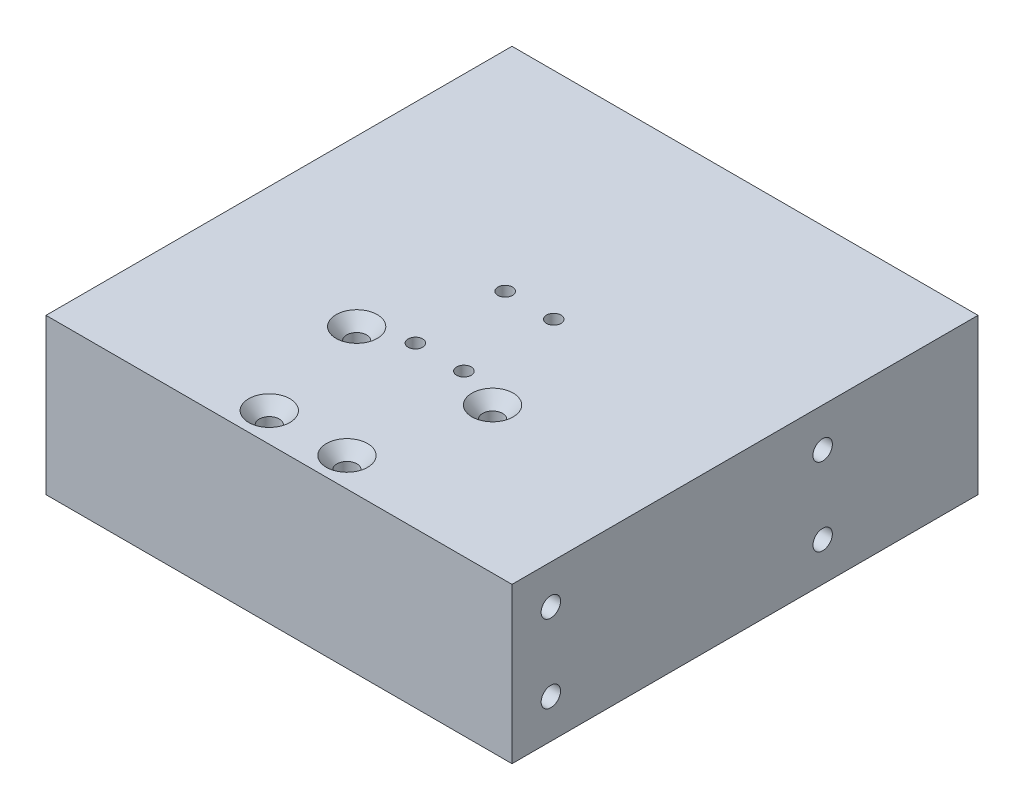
ISO-10303-21;
HEADER;
FILE_DESCRIPTION(('STEP AP214'),'2;1');
FILE_NAME('part.step','',(''),(''),'','','');
FILE_SCHEMA(('AUTOMOTIVE_DESIGN { 1 0 10303 214 1 1 1 1 }'));
ENDSEC;
DATA;
#1=APPLICATION_CONTEXT('core data for automotive mechanical design processes');
#2=APPLICATION_PROTOCOL_DEFINITION('international standard','automotive_design',2000,#1);
#3=PRODUCT_CONTEXT('',#1,'mechanical');
#4=PRODUCT('Part','Part','',(#3));
#5=PRODUCT_RELATED_PRODUCT_CATEGORY('part','',(#4));
#6=PRODUCT_DEFINITION_FORMATION('','',#4);
#7=PRODUCT_DEFINITION_CONTEXT('part definition',#1,'design');
#8=PRODUCT_DEFINITION('design','',#6,#7);
#9=PRODUCT_DEFINITION_SHAPE('','',#8);
#10=(LENGTH_UNIT() NAMED_UNIT(*) SI_UNIT(.MILLI.,.METRE.));
#11=(NAMED_UNIT(*) PLANE_ANGLE_UNIT() SI_UNIT($,.RADIAN.));
#12=(NAMED_UNIT(*) SI_UNIT($,.STERADIAN.) SOLID_ANGLE_UNIT());
#13=UNCERTAINTY_MEASURE_WITH_UNIT(LENGTH_MEASURE(1.E-05),#10,'distance_accuracy_value','');
#14=(GEOMETRIC_REPRESENTATION_CONTEXT(3) GLOBAL_UNCERTAINTY_ASSIGNED_CONTEXT((#13)) GLOBAL_UNIT_ASSIGNED_CONTEXT((#10,
#11,#12)) REPRESENTATION_CONTEXT('',''));
#15=CARTESIAN_POINT('',(0.,0.,0.));
#16=DIRECTION('',(0.,0.,1.));
#17=DIRECTION('',(1.,0.,0.));
#18=AXIS2_PLACEMENT_3D('',#15,#16,#17);
#19=CARTESIAN_POINT('',(0.,50.8,-152.4));
#20=DIRECTION('',(0.,0.,1.));
#21=DIRECTION('',(1.,0.,0.));
#22=AXIS2_PLACEMENT_3D('',#19,#20,#21);
#23=PLANE('',#22);
#24=DIRECTION('',(0.,1.,0.));
#25=VECTOR('',#24,1.);
#26=CARTESIAN_POINT('',(38.1,0.,-152.4));
#27=LINE('',#26,#25);
#28=CARTESIAN_POINT('',(38.1,0.,-152.4));
#29=VERTEX_POINT('',#28);
#30=CARTESIAN_POINT('',(38.1,6.35,-152.4));
#31=VERTEX_POINT('',#30);
#32=EDGE_CURVE('E168',#29,#31,#27,.T.);
#33=ORIENTED_EDGE('',*,*,#32,.F.);
#34=DIRECTION('',(-1.,0.,0.));
#35=VECTOR('',#34,1.);
#36=CARTESIAN_POINT('',(0.,0.,-152.4));
#37=LINE('',#36,#35);
#38=CARTESIAN_POINT('',(0.,0.,-152.4));
#39=VERTEX_POINT('',#38);
#40=EDGE_CURVE('E90',#29,#39,#37,.T.);
#41=ORIENTED_EDGE('',*,*,#40,.T.);
#42=DIRECTION('',(0.,-1.,0.));
#43=VECTOR('',#42,1.);
#44=CARTESIAN_POINT('',(0.,50.8,-152.4));
#45=LINE('',#44,#43);
#46=CARTESIAN_POINT('',(0.,50.8,-152.4));
#47=VERTEX_POINT('',#46);
#48=EDGE_CURVE('E299',#47,#39,#45,.T.);
#49=ORIENTED_EDGE('',*,*,#48,.F.);
#50=DIRECTION('',(-1.,0.,0.));
#51=VECTOR('',#50,1.);
#52=CARTESIAN_POINT('',(0.,50.8,-152.4));
#53=LINE('',#52,#51);
#54=CARTESIAN_POINT('',(152.4,50.8,-152.4));
#55=VERTEX_POINT('',#54);
#56=EDGE_CURVE('E68',#55,#47,#53,.T.);
#57=ORIENTED_EDGE('',*,*,#56,.F.);
#58=DIRECTION('',(0.,-1.,0.));
#59=VECTOR('',#58,1.);
#60=CARTESIAN_POINT('',(152.4,50.8,-152.4));
#61=LINE('',#60,#59);
#62=CARTESIAN_POINT('',(152.4,0.,-152.4));
#63=VERTEX_POINT('',#62);
#64=EDGE_CURVE('E310',#55,#63,#61,.T.);
#65=ORIENTED_EDGE('',*,*,#64,.T.);
#66=CARTESIAN_POINT('',(114.3,0.,-152.4));
#67=VERTEX_POINT('',#66);
#68=EDGE_CURVE('E294',#63,#67,#37,.T.);
#69=ORIENTED_EDGE('',*,*,#68,.T.);
#70=DIRECTION('',(0.,1.,0.));
#71=VECTOR('',#70,1.);
#72=CARTESIAN_POINT('',(114.3,0.,-152.4));
#73=LINE('',#72,#71);
#74=CARTESIAN_POINT('',(114.3,6.35,-152.4));
#75=VERTEX_POINT('',#74);
#76=EDGE_CURVE('E59',#67,#75,#73,.T.);
#77=ORIENTED_EDGE('',*,*,#76,.T.);
#78=DIRECTION('',(1.,0.,0.));
#79=VECTOR('',#78,1.);
#80=CARTESIAN_POINT('',(38.1,6.35,-152.4));
#81=LINE('',#80,#79);
#82=EDGE_CURVE('E162',#31,#75,#81,.T.);
#83=ORIENTED_EDGE('',*,*,#82,.F.);
#84=EDGE_LOOP('',(#33,#41,#49,#57,#65,#69,#77,#83));
#85=FACE_BOUND('',#84,.T.);
#86=ADVANCED_FACE('F42',(#85),#23,.F.);
#87=CARTESIAN_POINT('',(0.,0.,-152.4));
#88=DIRECTION('',(0.,-1.,0.));
#89=DIRECTION('',(0.,0.,-1.));
#90=AXIS2_PLACEMENT_3D('',#87,#88,#89);
#91=PLANE('',#90);
#92=CARTESIAN_POINT('',(63.5,0.,-9.52500000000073));
#93=DIRECTION('',(0.,1.,0.));
#94=DIRECTION('',(0.,0.,1.));
#95=AXIS2_PLACEMENT_3D('',#92,#93,#94);
#96=CIRCLE('',#95,3.26389999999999);
#97=CARTESIAN_POINT('',(63.5,0.,-6.26110000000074));
#98=VERTEX_POINT('',#97);
#99=EDGE_CURVE('E288',#98,#98,#96,.T.);
#100=ORIENTED_EDGE('',*,*,#99,.T.);
#101=EDGE_LOOP('',(#100));
#102=FACE_BOUND('',#101,.T.);
#103=CARTESIAN_POINT('',(88.9,0.,-9.52500000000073));
#104=DIRECTION('',(0.,1.,0.));
#105=DIRECTION('',(0.,0.,1.));
#106=AXIS2_PLACEMENT_3D('',#103,#104,#105);
#107=CIRCLE('',#106,3.26389999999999);
#108=CARTESIAN_POINT('',(88.9,0.,-6.26110000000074));
#109=VERTEX_POINT('',#108);
#110=EDGE_CURVE('E279',#109,#109,#107,.T.);
#111=ORIENTED_EDGE('',*,*,#110,.T.);
#112=EDGE_LOOP('',(#111));
#113=FACE_BOUND('',#112,.T.);
#114=CARTESIAN_POINT('',(53.975,0.,-47.6250000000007));
#115=DIRECTION('',(0.,1.,0.));
#116=DIRECTION('',(0.,0.,1.));
#117=AXIS2_PLACEMENT_3D('',#114,#115,#116);
#118=CIRCLE('',#117,3.26389999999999);
#119=CARTESIAN_POINT('',(53.975,0.,-44.3611000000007));
#120=VERTEX_POINT('',#119);
#121=EDGE_CURVE('E270',#120,#120,#118,.T.);
#122=ORIENTED_EDGE('',*,*,#121,.T.);
#123=EDGE_LOOP('',(#122));
#124=FACE_BOUND('',#123,.T.);
#125=CARTESIAN_POINT('',(98.425,0.,-47.6250000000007));
#126=DIRECTION('',(0.,1.,0.));
#127=DIRECTION('',(0.,0.,1.));
#128=AXIS2_PLACEMENT_3D('',#125,#126,#127);
#129=CIRCLE('',#128,3.26389999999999);
#130=CARTESIAN_POINT('',(98.425,0.,-44.3611000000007));
#131=VERTEX_POINT('',#130);
#132=EDGE_CURVE('E261',#131,#131,#129,.T.);
#133=ORIENTED_EDGE('',*,*,#132,.T.);
#134=EDGE_LOOP('',(#133));
#135=FACE_BOUND('',#134,.T.);
#136=ORIENTED_EDGE('',*,*,#40,.F.);
#137=DIRECTION('',(0.,0.,-1.));
#138=VECTOR('',#137,1.);
#139=CARTESIAN_POINT('',(38.1,0.,-142.875));
#140=LINE('',#139,#138);
#141=CARTESIAN_POINT('',(38.1,0.,-142.875));
#142=VERTEX_POINT('',#141);
#143=EDGE_CURVE('E172',#142,#29,#140,.T.);
#144=ORIENTED_EDGE('',*,*,#143,.F.);
#145=DIRECTION('',(1.,0.,0.));
#146=VECTOR('',#145,1.);
#147=CARTESIAN_POINT('',(38.1,0.,-142.875));
#148=LINE('',#147,#146);
#149=CARTESIAN_POINT('',(114.3,0.,-142.875));
#150=VERTEX_POINT('',#149);
#151=EDGE_CURVE('E178',#142,#150,#148,.T.);
#152=ORIENTED_EDGE('',*,*,#151,.T.);
#153=DIRECTION('',(0.,0.,-1.));
#154=VECTOR('',#153,1.);
#155=CARTESIAN_POINT('',(114.3,0.,-142.875));
#156=LINE('',#155,#154);
#157=EDGE_CURVE('E173',#150,#67,#156,.T.);
#158=ORIENTED_EDGE('',*,*,#157,.T.);
#159=ORIENTED_EDGE('',*,*,#68,.F.);
#160=DIRECTION('',(0.,0.,-1.));
#161=VECTOR('',#160,1.);
#162=CARTESIAN_POINT('',(152.4,0.,0.));
#163=LINE('',#162,#161);
#164=CARTESIAN_POINT('',(152.4,0.,0.));
#165=VERTEX_POINT('',#164);
#166=EDGE_CURVE('E304',#165,#63,#163,.T.);
#167=ORIENTED_EDGE('',*,*,#166,.F.);
#168=DIRECTION('',(1.,0.,0.));
#169=VECTOR('',#168,1.);
#170=CARTESIAN_POINT('',(0.,0.,0.));
#171=LINE('',#170,#169);
#172=CARTESIAN_POINT('',(0.,0.,0.));
#173=VERTEX_POINT('',#172);
#174=EDGE_CURVE('E302',#173,#165,#171,.T.);
#175=ORIENTED_EDGE('',*,*,#174,.F.);
#176=DIRECTION('',(0.,0.,1.));
#177=VECTOR('',#176,1.);
#178=CARTESIAN_POINT('',(0.,0.,0.));
#179=LINE('',#178,#177);
#180=EDGE_CURVE('E291',#39,#173,#179,.T.);
#181=ORIENTED_EDGE('',*,*,#180,.F.);
#182=EDGE_LOOP('',(#136,#144,#152,#158,#159,#167,#175,#181));
#183=FACE_BOUND('',#182,.T.);
#184=ADVANCED_FACE('F321',(#102,#113,#124,#135,#183),#91,.T.);
#185=CARTESIAN_POINT('',(0.,50.8,0.));
#186=DIRECTION('',(1.,0.,0.));
#187=DIRECTION('',(0.,0.,-1.));
#188=AXIS2_PLACEMENT_3D('',#185,#186,#187);
#189=PLANE('',#188);
#190=CARTESIAN_POINT('',(0.,38.1000000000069,-101.600000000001));
#191=DIRECTION('',(-1.,0.,0.));
#192=DIRECTION('',(0.,0.,1.));
#193=AXIS2_PLACEMENT_3D('',#190,#191,#192);
#194=CIRCLE('',#193,3.17499999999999);
#195=CARTESIAN_POINT('',(0.,38.1000000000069,-98.4250000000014));
#196=VERTEX_POINT('',#195);
#197=EDGE_CURVE('E183',#196,#196,#194,.T.);
#198=ORIENTED_EDGE('',*,*,#197,.F.);
#199=EDGE_LOOP('',(#198));
#200=FACE_BOUND('',#199,.T.);
#201=CARTESIAN_POINT('',(0.,38.1000000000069,-12.7000000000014));
#202=DIRECTION('',(-1.,0.,0.));
#203=DIRECTION('',(0.,0.,1.));
#204=AXIS2_PLACEMENT_3D('',#201,#202,#203);
#205=CIRCLE('',#204,3.17499999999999);
#206=CARTESIAN_POINT('',(0.,38.1000000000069,-9.5250000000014));
#207=VERTEX_POINT('',#206);
#208=EDGE_CURVE('E189',#207,#207,#205,.T.);
#209=ORIENTED_EDGE('',*,*,#208,.F.);
#210=EDGE_LOOP('',(#209));
#211=FACE_BOUND('',#210,.T.);
#212=CARTESIAN_POINT('',(0.,12.7000000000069,-12.7000000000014));
#213=DIRECTION('',(-1.,0.,0.));
#214=DIRECTION('',(0.,0.,1.));
#215=AXIS2_PLACEMENT_3D('',#212,#213,#214);
#216=CIRCLE('',#215,3.17499999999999);
#217=CARTESIAN_POINT('',(0.,12.7000000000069,-9.5250000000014));
#218=VERTEX_POINT('',#217);
#219=EDGE_CURVE('E195',#218,#218,#216,.T.);
#220=ORIENTED_EDGE('',*,*,#219,.F.);
#221=EDGE_LOOP('',(#220));
#222=FACE_BOUND('',#221,.T.);
#223=CARTESIAN_POINT('',(0.,12.7000000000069,-101.600000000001));
#224=DIRECTION('',(-1.,0.,0.));
#225=DIRECTION('',(0.,0.,1.));
#226=AXIS2_PLACEMENT_3D('',#223,#224,#225);
#227=CIRCLE('',#226,3.17499999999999);
#228=CARTESIAN_POINT('',(0.,12.7000000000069,-98.4250000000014));
#229=VERTEX_POINT('',#228);
#230=EDGE_CURVE('E201',#229,#229,#227,.T.);
#231=ORIENTED_EDGE('',*,*,#230,.F.);
#232=EDGE_LOOP('',(#231));
#233=FACE_BOUND('',#232,.T.);
#234=ORIENTED_EDGE('',*,*,#180,.T.);
#235=DIRECTION('',(0.,-1.,0.));
#236=VECTOR('',#235,1.);
#237=CARTESIAN_POINT('',(0.,50.8,0.));
#238=LINE('',#237,#236);
#239=CARTESIAN_POINT('',(0.,50.8,0.));
#240=VERTEX_POINT('',#239);
#241=EDGE_CURVE('E11',#240,#173,#238,.T.);
#242=ORIENTED_EDGE('',*,*,#241,.F.);
#243=DIRECTION('',(0.,0.,1.));
#244=VECTOR('',#243,1.);
#245=CARTESIAN_POINT('',(0.,50.8,0.));
#246=LINE('',#245,#244);
#247=EDGE_CURVE('E292',#47,#240,#246,.T.);
#248=ORIENTED_EDGE('',*,*,#247,.F.);
#249=ORIENTED_EDGE('',*,*,#48,.T.);
#250=EDGE_LOOP('',(#234,#242,#248,#249));
#251=FACE_BOUND('',#250,.T.);
#252=ADVANCED_FACE('F44',(#200,#211,#222,#233,#251),#189,.F.);
#253=CARTESIAN_POINT('',(0.,50.8,0.));
#254=DIRECTION('',(0.,0.,-1.));
#255=DIRECTION('',(-1.,0.,0.));
#256=AXIS2_PLACEMENT_3D('',#253,#254,#255);
#257=PLANE('',#256);
#258=ORIENTED_EDGE('',*,*,#174,.T.);
#259=DIRECTION('',(0.,-1.,0.));
#260=VECTOR('',#259,1.);
#261=CARTESIAN_POINT('',(152.4,50.8,0.));
#262=LINE('',#261,#260);
#263=CARTESIAN_POINT('',(152.4,50.8,0.));
#264=VERTEX_POINT('',#263);
#265=EDGE_CURVE('E50',#264,#165,#262,.T.);
#266=ORIENTED_EDGE('',*,*,#265,.F.);
#267=DIRECTION('',(1.,0.,0.));
#268=VECTOR('',#267,1.);
#269=CARTESIAN_POINT('',(0.,50.8,0.));
#270=LINE('',#269,#268);
#271=EDGE_CURVE('E97',#240,#264,#270,.T.);
#272=ORIENTED_EDGE('',*,*,#271,.F.);
#273=ORIENTED_EDGE('',*,*,#241,.T.);
#274=EDGE_LOOP('',(#258,#266,#272,#273));
#275=FACE_BOUND('',#274,.T.);
#276=ADVANCED_FACE('F339',(#275),#257,.F.);
#277=CARTESIAN_POINT('',(152.4,50.8,0.));
#278=DIRECTION('',(-1.,0.,0.));
#279=DIRECTION('',(0.,0.,1.));
#280=AXIS2_PLACEMENT_3D('',#277,#278,#279);
#281=PLANE('',#280);
#282=CARTESIAN_POINT('',(152.4,38.1000000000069,-101.600000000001));
#283=DIRECTION('',(1.,0.,0.));
#284=DIRECTION('',(0.,0.,-1.));
#285=AXIS2_PLACEMENT_3D('',#282,#283,#284);
#286=CIRCLE('',#285,3.17499999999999);
#287=CARTESIAN_POINT('',(152.4,38.1000000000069,-104.775000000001));
#288=VERTEX_POINT('',#287);
#289=EDGE_CURVE('E207',#288,#288,#286,.T.);
#290=ORIENTED_EDGE('',*,*,#289,.F.);
#291=EDGE_LOOP('',(#290));
#292=FACE_BOUND('',#291,.T.);
#293=CARTESIAN_POINT('',(152.4,38.1000000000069,-12.7000000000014));
#294=DIRECTION('',(1.,0.,0.));
#295=DIRECTION('',(0.,0.,-1.));
#296=AXIS2_PLACEMENT_3D('',#293,#294,#295);
#297=CIRCLE('',#296,3.17499999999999);
#298=CARTESIAN_POINT('',(152.4,38.1000000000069,-15.8750000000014));
#299=VERTEX_POINT('',#298);
#300=EDGE_CURVE('E213',#299,#299,#297,.T.);
#301=ORIENTED_EDGE('',*,*,#300,.F.);
#302=EDGE_LOOP('',(#301));
#303=FACE_BOUND('',#302,.T.);
#304=CARTESIAN_POINT('',(152.4,12.7000000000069,-12.7000000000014));
#305=DIRECTION('',(1.,0.,0.));
#306=DIRECTION('',(0.,0.,-1.));
#307=AXIS2_PLACEMENT_3D('',#304,#305,#306);
#308=CIRCLE('',#307,3.17499999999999);
#309=CARTESIAN_POINT('',(152.4,12.7000000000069,-15.8750000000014));
#310=VERTEX_POINT('',#309);
#311=EDGE_CURVE('E219',#310,#310,#308,.T.);
#312=ORIENTED_EDGE('',*,*,#311,.F.);
#313=EDGE_LOOP('',(#312));
#314=FACE_BOUND('',#313,.T.);
#315=CARTESIAN_POINT('',(152.4,12.7000000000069,-101.600000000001));
#316=DIRECTION('',(1.,0.,0.));
#317=DIRECTION('',(0.,0.,-1.));
#318=AXIS2_PLACEMENT_3D('',#315,#316,#317);
#319=CIRCLE('',#318,3.17499999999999);
#320=CARTESIAN_POINT('',(152.4,12.7000000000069,-104.775000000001));
#321=VERTEX_POINT('',#320);
#322=EDGE_CURVE('E225',#321,#321,#319,.T.);
#323=ORIENTED_EDGE('',*,*,#322,.F.);
#324=EDGE_LOOP('',(#323));
#325=FACE_BOUND('',#324,.T.);
#326=ORIENTED_EDGE('',*,*,#166,.T.);
#327=ORIENTED_EDGE('',*,*,#64,.F.);
#328=DIRECTION('',(0.,0.,-1.));
#329=VECTOR('',#328,1.);
#330=CARTESIAN_POINT('',(152.4,50.8,0.));
#331=LINE('',#330,#329);
#332=EDGE_CURVE('E296',#264,#55,#331,.T.);
#333=ORIENTED_EDGE('',*,*,#332,.F.);
#334=ORIENTED_EDGE('',*,*,#265,.T.);
#335=EDGE_LOOP('',(#326,#327,#333,#334));
#336=FACE_BOUND('',#335,.T.);
#337=ADVANCED_FACE('F317',(#292,#303,#314,#325,#336),#281,.F.);
#338=CARTESIAN_POINT('',(0.,50.8,-152.4));
#339=DIRECTION('',(0.,-1.,0.));
#340=DIRECTION('',(0.,0.,-1.));
#341=AXIS2_PLACEMENT_3D('',#338,#339,#340);
#342=PLANE('',#341);
#343=CARTESIAN_POINT('',(84.1374999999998,50.8,-81.9073755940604));
#344=DIRECTION('',(0.,1.,0.));
#345=DIRECTION('',(0.,0.,1.));
#346=AXIS2_PLACEMENT_3D('',#343,#344,#345);
#347=CIRCLE('',#346,2.38125);
#348=CARTESIAN_POINT('',(84.1374999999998,50.8,-79.5261255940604));
#349=VERTEX_POINT('',#348);
#350=EDGE_CURVE('E231',#349,#349,#347,.T.);
#351=ORIENTED_EDGE('',*,*,#350,.F.);
#352=EDGE_LOOP('',(#351));
#353=FACE_BOUND('',#352,.T.);
#354=CARTESIAN_POINT('',(68.2624999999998,50.8,-81.9073755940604));
#355=DIRECTION('',(0.,1.,0.));
#356=DIRECTION('',(0.,0.,1.));
#357=AXIS2_PLACEMENT_3D('',#354,#355,#356);
#358=CIRCLE('',#357,2.38125);
#359=CARTESIAN_POINT('',(68.2624999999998,50.8,-79.5261255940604));
#360=VERTEX_POINT('',#359);
#361=EDGE_CURVE('E237',#360,#360,#358,.T.);
#362=ORIENTED_EDGE('',*,*,#361,.F.);
#363=EDGE_LOOP('',(#362));
#364=FACE_BOUND('',#363,.T.);
#365=CARTESIAN_POINT('',(68.2624999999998,50.8,-52.5386255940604));
#366=DIRECTION('',(0.,1.,0.));
#367=DIRECTION('',(0.,0.,1.));
#368=AXIS2_PLACEMENT_3D('',#365,#366,#367);
#369=CIRCLE('',#368,2.38125);
#370=CARTESIAN_POINT('',(68.2624999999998,50.8,-50.1573755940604));
#371=VERTEX_POINT('',#370);
#372=EDGE_CURVE('E243',#371,#371,#369,.T.);
#373=ORIENTED_EDGE('',*,*,#372,.F.);
#374=EDGE_LOOP('',(#373));
#375=FACE_BOUND('',#374,.T.);
#376=CARTESIAN_POINT('',(84.1374999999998,50.8,-52.5386255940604));
#377=DIRECTION('',(0.,1.,0.));
#378=DIRECTION('',(0.,0.,1.));
#379=AXIS2_PLACEMENT_3D('',#376,#377,#378);
#380=CIRCLE('',#379,2.38125);
#381=CARTESIAN_POINT('',(84.1374999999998,50.8,-50.1573755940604));
#382=VERTEX_POINT('',#381);
#383=EDGE_CURVE('E249',#382,#382,#380,.T.);
#384=ORIENTED_EDGE('',*,*,#383,.F.);
#385=EDGE_LOOP('',(#384));
#386=FACE_BOUND('',#385,.T.);
#387=CARTESIAN_POINT('',(98.425,50.8,-47.6250000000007));
#388=DIRECTION('',(0.,1.,0.));
#389=DIRECTION('',(0.,0.,1.));
#390=AXIS2_PLACEMENT_3D('',#387,#388,#389);
#391=CIRCLE('',#390,6.7437);
#392=CARTESIAN_POINT('',(98.425,50.8,-40.8813000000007));
#393=VERTEX_POINT('',#392);
#394=EDGE_CURVE('E255',#393,#393,#391,.T.);
#395=ORIENTED_EDGE('',*,*,#394,.F.);
#396=EDGE_LOOP('',(#395));
#397=FACE_BOUND('',#396,.T.);
#398=CARTESIAN_POINT('',(53.975,50.8,-47.6250000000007));
#399=DIRECTION('',(0.,1.,0.));
#400=DIRECTION('',(0.,0.,1.));
#401=AXIS2_PLACEMENT_3D('',#398,#399,#400);
#402=CIRCLE('',#401,6.7437);
#403=CARTESIAN_POINT('',(53.975,50.8,-40.8813000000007));
#404=VERTEX_POINT('',#403);
#405=EDGE_CURVE('E264',#404,#404,#402,.T.);
#406=ORIENTED_EDGE('',*,*,#405,.F.);
#407=EDGE_LOOP('',(#406));
#408=FACE_BOUND('',#407,.T.);
#409=CARTESIAN_POINT('',(88.9,50.8,-9.52500000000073));
#410=DIRECTION('',(0.,1.,0.));
#411=DIRECTION('',(0.,0.,1.));
#412=AXIS2_PLACEMENT_3D('',#409,#410,#411);
#413=CIRCLE('',#412,6.7437);
#414=CARTESIAN_POINT('',(88.9,50.8,-2.78130000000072));
#415=VERTEX_POINT('',#414);
#416=EDGE_CURVE('E273',#415,#415,#413,.T.);
#417=ORIENTED_EDGE('',*,*,#416,.F.);
#418=EDGE_LOOP('',(#417));
#419=FACE_BOUND('',#418,.T.);
#420=CARTESIAN_POINT('',(63.5,50.8,-9.52500000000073));
#421=DIRECTION('',(0.,1.,0.));
#422=DIRECTION('',(0.,0.,1.));
#423=AXIS2_PLACEMENT_3D('',#420,#421,#422);
#424=CIRCLE('',#423,6.7437);
#425=CARTESIAN_POINT('',(63.5,50.8,-2.78130000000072));
#426=VERTEX_POINT('',#425);
#427=EDGE_CURVE('E282',#426,#426,#424,.T.);
#428=ORIENTED_EDGE('',*,*,#427,.F.);
#429=EDGE_LOOP('',(#428));
#430=FACE_BOUND('',#429,.T.);
#431=ORIENTED_EDGE('',*,*,#247,.T.);
#432=ORIENTED_EDGE('',*,*,#271,.T.);
#433=ORIENTED_EDGE('',*,*,#332,.T.);
#434=ORIENTED_EDGE('',*,*,#56,.T.);
#435=EDGE_LOOP('',(#431,#432,#433,#434));
#436=FACE_BOUND('',#435,.T.);
#437=ADVANCED_FACE('F327',(#353,#364,#375,#386,#397,#408,#419,#430,#436),#342,.F.);
#438=CARTESIAN_POINT('',(63.5,50.8,-9.52500000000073));
#439=DIRECTION('',(0.,1.,0.));
#440=DIRECTION('',(0.,0.,1.));
#441=AXIS2_PLACEMENT_3D('',#438,#439,#440);
#442=CYLINDRICAL_SURFACE('',#441,3.26389999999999);
#443=ORIENTED_EDGE('',*,*,#99,.F.);
#444=EDGE_LOOP('',(#443));
#445=FACE_BOUND('',#444,.T.);
#446=CARTESIAN_POINT('',(63.5,46.7969480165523,-9.52500000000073));
#447=DIRECTION('',(0.,1.,0.));
#448=DIRECTION('',(0.,0.,1.));
#449=AXIS2_PLACEMENT_3D('',#446,#447,#448);
#450=CIRCLE('',#449,3.2639);
#451=CARTESIAN_POINT('',(63.5,46.7969480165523,-6.26110000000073));
#452=VERTEX_POINT('',#451);
#453=EDGE_CURVE('E285',#452,#452,#450,.T.);
#454=ORIENTED_EDGE('',*,*,#453,.T.);
#455=EDGE_LOOP('',(#454));
#456=FACE_BOUND('',#455,.T.);
#457=ADVANCED_FACE('F329',(#445,#456),#442,.F.);
#458=CARTESIAN_POINT('',(63.5,50.8,-9.52500000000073));
#459=DIRECTION('',(0.,1.,0.));
#460=DIRECTION('',(0.,0.,1.));
#461=AXIS2_PLACEMENT_3D('',#458,#459,#460);
#462=CONICAL_SURFACE('',#461,6.7437,0.715584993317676);
#463=ORIENTED_EDGE('',*,*,#453,.F.);
#464=EDGE_LOOP('',(#463));
#465=FACE_BOUND('',#464,.T.);
#466=ORIENTED_EDGE('',*,*,#427,.T.);
#467=EDGE_LOOP('',(#466));
#468=FACE_BOUND('',#467,.T.);
#469=ADVANCED_FACE('F336',(#465,#468),#462,.F.);
#470=CARTESIAN_POINT('',(88.9,50.8,-9.52500000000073));
#471=DIRECTION('',(0.,1.,0.));
#472=DIRECTION('',(0.,0.,1.));
#473=AXIS2_PLACEMENT_3D('',#470,#471,#472);
#474=CYLINDRICAL_SURFACE('',#473,3.26389999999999);
#475=ORIENTED_EDGE('',*,*,#110,.F.);
#476=EDGE_LOOP('',(#475));
#477=FACE_BOUND('',#476,.T.);
#478=CARTESIAN_POINT('',(88.9,46.7969480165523,-9.52500000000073));
#479=DIRECTION('',(0.,1.,0.));
#480=DIRECTION('',(0.,0.,1.));
#481=AXIS2_PLACEMENT_3D('',#478,#479,#480);
#482=CIRCLE('',#481,3.2639);
#483=CARTESIAN_POINT('',(88.9,46.7969480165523,-6.26110000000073));
#484=VERTEX_POINT('',#483);
#485=EDGE_CURVE('E276',#484,#484,#482,.T.);
#486=ORIENTED_EDGE('',*,*,#485,.T.);
#487=EDGE_LOOP('',(#486));
#488=FACE_BOUND('',#487,.T.);
#489=ADVANCED_FACE('F498',(#477,#488),#474,.F.);
#490=CARTESIAN_POINT('',(88.9,50.8,-9.52500000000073));
#491=DIRECTION('',(0.,1.,0.));
#492=DIRECTION('',(0.,0.,1.));
#493=AXIS2_PLACEMENT_3D('',#490,#491,#492);
#494=CONICAL_SURFACE('',#493,6.7437,0.715584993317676);
#495=ORIENTED_EDGE('',*,*,#485,.F.);
#496=EDGE_LOOP('',(#495));
#497=FACE_BOUND('',#496,.T.);
#498=ORIENTED_EDGE('',*,*,#416,.T.);
#499=EDGE_LOOP('',(#498));
#500=FACE_BOUND('',#499,.T.);
#501=ADVANCED_FACE('F494',(#497,#500),#494,.F.);
#502=CARTESIAN_POINT('',(53.975,50.8,-47.6250000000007));
#503=DIRECTION('',(0.,1.,0.));
#504=DIRECTION('',(0.,0.,1.));
#505=AXIS2_PLACEMENT_3D('',#502,#503,#504);
#506=CYLINDRICAL_SURFACE('',#505,3.26389999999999);
#507=ORIENTED_EDGE('',*,*,#121,.F.);
#508=EDGE_LOOP('',(#507));
#509=FACE_BOUND('',#508,.T.);
#510=CARTESIAN_POINT('',(53.975,46.7969480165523,-47.6250000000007));
#511=DIRECTION('',(0.,1.,0.));
#512=DIRECTION('',(0.,0.,1.));
#513=AXIS2_PLACEMENT_3D('',#510,#511,#512);
#514=CIRCLE('',#513,3.26389999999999);
#515=CARTESIAN_POINT('',(53.975,46.7969480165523,-44.3611000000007));
#516=VERTEX_POINT('',#515);
#517=EDGE_CURVE('E267',#516,#516,#514,.T.);
#518=ORIENTED_EDGE('',*,*,#517,.T.);
#519=EDGE_LOOP('',(#518));
#520=FACE_BOUND('',#519,.T.);
#521=ADVANCED_FACE('F490',(#509,#520),#506,.F.);
#522=CARTESIAN_POINT('',(53.975,50.8,-47.6250000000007));
#523=DIRECTION('',(0.,1.,0.));
#524=DIRECTION('',(0.,0.,1.));
#525=AXIS2_PLACEMENT_3D('',#522,#523,#524);
#526=CONICAL_SURFACE('',#525,6.7437,0.715584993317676);
#527=ORIENTED_EDGE('',*,*,#517,.F.);
#528=EDGE_LOOP('',(#527));
#529=FACE_BOUND('',#528,.T.);
#530=ORIENTED_EDGE('',*,*,#405,.T.);
#531=EDGE_LOOP('',(#530));
#532=FACE_BOUND('',#531,.T.);
#533=ADVANCED_FACE('F486',(#529,#532),#526,.F.);
#534=CARTESIAN_POINT('',(98.425,50.8,-47.6250000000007));
#535=DIRECTION('',(0.,1.,0.));
#536=DIRECTION('',(0.,0.,1.));
#537=AXIS2_PLACEMENT_3D('',#534,#535,#536);
#538=CYLINDRICAL_SURFACE('',#537,3.26389999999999);
#539=ORIENTED_EDGE('',*,*,#132,.F.);
#540=EDGE_LOOP('',(#539));
#541=FACE_BOUND('',#540,.T.);
#542=CARTESIAN_POINT('',(98.425,46.7969480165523,-47.6250000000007));
#543=DIRECTION('',(0.,1.,0.));
#544=DIRECTION('',(0.,0.,1.));
#545=AXIS2_PLACEMENT_3D('',#542,#543,#544);
#546=CIRCLE('',#545,3.2639);
#547=CARTESIAN_POINT('',(98.425,46.7969480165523,-44.3611000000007));
#548=VERTEX_POINT('',#547);
#549=EDGE_CURVE('E258',#548,#548,#546,.T.);
#550=ORIENTED_EDGE('',*,*,#549,.T.);
#551=EDGE_LOOP('',(#550));
#552=FACE_BOUND('',#551,.T.);
#553=ADVANCED_FACE('F482',(#541,#552),#538,.F.);
#554=CARTESIAN_POINT('',(98.425,50.8,-47.6250000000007));
#555=DIRECTION('',(0.,1.,0.));
#556=DIRECTION('',(0.,0.,1.));
#557=AXIS2_PLACEMENT_3D('',#554,#555,#556);
#558=CONICAL_SURFACE('',#557,6.7437,0.715584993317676);
#559=ORIENTED_EDGE('',*,*,#549,.F.);
#560=EDGE_LOOP('',(#559));
#561=FACE_BOUND('',#560,.T.);
#562=ORIENTED_EDGE('',*,*,#394,.T.);
#563=EDGE_LOOP('',(#562));
#564=FACE_BOUND('',#563,.T.);
#565=ADVANCED_FACE('F478',(#561,#564),#558,.F.);
#566=CARTESIAN_POINT('',(84.1374999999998,44.7548,-52.5386255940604));
#567=DIRECTION('',(0.,1.,0.));
#568=DIRECTION('',(0.,0.,1.));
#569=AXIS2_PLACEMENT_3D('',#566,#567,#568);
#570=CONICAL_SURFACE('',#569,2.38125,1.02974425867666);
#571=CARTESIAN_POINT('',(84.1374999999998,43.3240006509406,-52.5386255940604));
#572=VERTEX_POINT('',#571);
#573=VERTEX_LOOP('',#572);
#574=FACE_BOUND('',#573,.T.);
#575=CARTESIAN_POINT('',(84.1374999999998,44.7548,-52.5386255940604));
#576=DIRECTION('',(0.,1.,0.));
#577=DIRECTION('',(0.,0.,1.));
#578=AXIS2_PLACEMENT_3D('',#575,#576,#577);
#579=CIRCLE('',#578,2.38125);
#580=CARTESIAN_POINT('',(84.1374999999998,44.7548,-50.1573755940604));
#581=VERTEX_POINT('',#580);
#582=EDGE_CURVE('E252',#581,#581,#579,.T.);
#583=ORIENTED_EDGE('',*,*,#582,.T.);
#584=EDGE_LOOP('',(#583));
#585=FACE_BOUND('',#584,.T.);
#586=ADVANCED_FACE('F474',(#574,#585),#570,.F.);
#587=CARTESIAN_POINT('',(84.1374999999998,50.8,-52.5386255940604));
#588=DIRECTION('',(0.,1.,0.));
#589=DIRECTION('',(0.,0.,1.));
#590=AXIS2_PLACEMENT_3D('',#587,#588,#589);
#591=CYLINDRICAL_SURFACE('',#590,2.38125);
#592=ORIENTED_EDGE('',*,*,#582,.F.);
#593=EDGE_LOOP('',(#592));
#594=FACE_BOUND('',#593,.T.);
#595=ORIENTED_EDGE('',*,*,#383,.T.);
#596=EDGE_LOOP('',(#595));
#597=FACE_BOUND('',#596,.T.);
#598=ADVANCED_FACE('F470',(#594,#597),#591,.F.);
#599=CARTESIAN_POINT('',(68.2624999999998,44.7548,-52.5386255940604));
#600=DIRECTION('',(0.,1.,0.));
#601=DIRECTION('',(0.,0.,1.));
#602=AXIS2_PLACEMENT_3D('',#599,#600,#601);
#603=CONICAL_SURFACE('',#602,2.38125,1.02974425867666);
#604=CARTESIAN_POINT('',(68.2624999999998,43.3240006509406,-52.5386255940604));
#605=VERTEX_POINT('',#604);
#606=VERTEX_LOOP('',#605);
#607=FACE_BOUND('',#606,.T.);
#608=CARTESIAN_POINT('',(68.2624999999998,44.7548,-52.5386255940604));
#609=DIRECTION('',(0.,1.,0.));
#610=DIRECTION('',(0.,0.,1.));
#611=AXIS2_PLACEMENT_3D('',#608,#609,#610);
#612=CIRCLE('',#611,2.38125);
#613=CARTESIAN_POINT('',(68.2624999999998,44.7548,-50.1573755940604));
#614=VERTEX_POINT('',#613);
#615=EDGE_CURVE('E246',#614,#614,#612,.T.);
#616=ORIENTED_EDGE('',*,*,#615,.T.);
#617=EDGE_LOOP('',(#616));
#618=FACE_BOUND('',#617,.T.);
#619=ADVANCED_FACE('F466',(#607,#618),#603,.F.);
#620=CARTESIAN_POINT('',(68.2624999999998,50.8,-52.5386255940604));
#621=DIRECTION('',(0.,1.,0.));
#622=DIRECTION('',(0.,0.,1.));
#623=AXIS2_PLACEMENT_3D('',#620,#621,#622);
#624=CYLINDRICAL_SURFACE('',#623,2.38125);
#625=ORIENTED_EDGE('',*,*,#615,.F.);
#626=EDGE_LOOP('',(#625));
#627=FACE_BOUND('',#626,.T.);
#628=ORIENTED_EDGE('',*,*,#372,.T.);
#629=EDGE_LOOP('',(#628));
#630=FACE_BOUND('',#629,.T.);
#631=ADVANCED_FACE('F462',(#627,#630),#624,.F.);
#632=CARTESIAN_POINT('',(68.2624999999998,44.7548,-81.9073755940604));
#633=DIRECTION('',(0.,1.,0.));
#634=DIRECTION('',(0.,0.,1.));
#635=AXIS2_PLACEMENT_3D('',#632,#633,#634);
#636=CONICAL_SURFACE('',#635,2.38125,1.02974425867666);
#637=CARTESIAN_POINT('',(68.2624999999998,43.3240006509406,-81.9073755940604));
#638=VERTEX_POINT('',#637);
#639=VERTEX_LOOP('',#638);
#640=FACE_BOUND('',#639,.T.);
#641=CARTESIAN_POINT('',(68.2624999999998,44.7548,-81.9073755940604));
#642=DIRECTION('',(0.,1.,0.));
#643=DIRECTION('',(0.,0.,1.));
#644=AXIS2_PLACEMENT_3D('',#641,#642,#643);
#645=CIRCLE('',#644,2.38125);
#646=CARTESIAN_POINT('',(68.2624999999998,44.7548,-79.5261255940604));
#647=VERTEX_POINT('',#646);
#648=EDGE_CURVE('E240',#647,#647,#645,.T.);
#649=ORIENTED_EDGE('',*,*,#648,.T.);
#650=EDGE_LOOP('',(#649));
#651=FACE_BOUND('',#650,.T.);
#652=ADVANCED_FACE('F458',(#640,#651),#636,.F.);
#653=CARTESIAN_POINT('',(68.2624999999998,50.8,-81.9073755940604));
#654=DIRECTION('',(0.,1.,0.));
#655=DIRECTION('',(0.,0.,1.));
#656=AXIS2_PLACEMENT_3D('',#653,#654,#655);
#657=CYLINDRICAL_SURFACE('',#656,2.38125);
#658=ORIENTED_EDGE('',*,*,#648,.F.);
#659=EDGE_LOOP('',(#658));
#660=FACE_BOUND('',#659,.T.);
#661=ORIENTED_EDGE('',*,*,#361,.T.);
#662=EDGE_LOOP('',(#661));
#663=FACE_BOUND('',#662,.T.);
#664=ADVANCED_FACE('F454',(#660,#663),#657,.F.);
#665=CARTESIAN_POINT('',(84.1374999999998,44.7548,-81.9073755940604));
#666=DIRECTION('',(0.,1.,0.));
#667=DIRECTION('',(0.,0.,1.));
#668=AXIS2_PLACEMENT_3D('',#665,#666,#667);
#669=CONICAL_SURFACE('',#668,2.38125,1.02974425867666);
#670=CARTESIAN_POINT('',(84.1374999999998,43.3240006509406,-81.9073755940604));
#671=VERTEX_POINT('',#670);
#672=VERTEX_LOOP('',#671);
#673=FACE_BOUND('',#672,.T.);
#674=CARTESIAN_POINT('',(84.1374999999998,44.7548,-81.9073755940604));
#675=DIRECTION('',(0.,1.,0.));
#676=DIRECTION('',(0.,0.,1.));
#677=AXIS2_PLACEMENT_3D('',#674,#675,#676);
#678=CIRCLE('',#677,2.38125);
#679=CARTESIAN_POINT('',(84.1374999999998,44.7548,-79.5261255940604));
#680=VERTEX_POINT('',#679);
#681=EDGE_CURVE('E234',#680,#680,#678,.T.);
#682=ORIENTED_EDGE('',*,*,#681,.T.);
#683=EDGE_LOOP('',(#682));
#684=FACE_BOUND('',#683,.T.);
#685=ADVANCED_FACE('F450',(#673,#684),#669,.F.);
#686=CARTESIAN_POINT('',(84.1374999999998,50.8,-81.9073755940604));
#687=DIRECTION('',(0.,1.,0.));
#688=DIRECTION('',(0.,0.,1.));
#689=AXIS2_PLACEMENT_3D('',#686,#687,#688);
#690=CYLINDRICAL_SURFACE('',#689,2.38125);
#691=ORIENTED_EDGE('',*,*,#681,.F.);
#692=EDGE_LOOP('',(#691));
#693=FACE_BOUND('',#692,.T.);
#694=ORIENTED_EDGE('',*,*,#350,.T.);
#695=EDGE_LOOP('',(#694));
#696=FACE_BOUND('',#695,.T.);
#697=ADVANCED_FACE('F446',(#693,#696),#690,.F.);
#698=CARTESIAN_POINT('',(145.6436,12.7000000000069,-101.600000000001));
#699=DIRECTION('',(1.,0.,0.));
#700=DIRECTION('',(0.,0.,-1.));
#701=AXIS2_PLACEMENT_3D('',#698,#699,#700);
#702=CONICAL_SURFACE('',#701,3.175,1.02974425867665);
#703=CARTESIAN_POINT('',(143.735867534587,12.7000000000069,-101.600000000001));
#704=VERTEX_POINT('',#703);
#705=VERTEX_LOOP('',#704);
#706=FACE_BOUND('',#705,.T.);
#707=CARTESIAN_POINT('',(145.6436,12.7000000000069,-101.600000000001));
#708=DIRECTION('',(1.,0.,0.));
#709=DIRECTION('',(0.,0.,-1.));
#710=AXIS2_PLACEMENT_3D('',#707,#708,#709);
#711=CIRCLE('',#710,3.175);
#712=CARTESIAN_POINT('',(145.6436,12.7000000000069,-104.775000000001));
#713=VERTEX_POINT('',#712);
#714=EDGE_CURVE('E228',#713,#713,#711,.T.);
#715=ORIENTED_EDGE('',*,*,#714,.T.);
#716=EDGE_LOOP('',(#715));
#717=FACE_BOUND('',#716,.T.);
#718=ADVANCED_FACE('F442',(#706,#717),#702,.F.);
#719=CARTESIAN_POINT('',(152.4,12.7000000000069,-101.600000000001));
#720=DIRECTION('',(1.,0.,0.));
#721=DIRECTION('',(0.,0.,-1.));
#722=AXIS2_PLACEMENT_3D('',#719,#720,#721);
#723=CYLINDRICAL_SURFACE('',#722,3.17499999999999);
#724=ORIENTED_EDGE('',*,*,#714,.F.);
#725=EDGE_LOOP('',(#724));
#726=FACE_BOUND('',#725,.T.);
#727=ORIENTED_EDGE('',*,*,#322,.T.);
#728=EDGE_LOOP('',(#727));
#729=FACE_BOUND('',#728,.T.);
#730=ADVANCED_FACE('F438',(#726,#729),#723,.F.);
#731=CARTESIAN_POINT('',(145.6436,12.7000000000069,-12.7000000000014));
#732=DIRECTION('',(1.,0.,0.));
#733=DIRECTION('',(0.,0.,-1.));
#734=AXIS2_PLACEMENT_3D('',#731,#732,#733);
#735=CONICAL_SURFACE('',#734,3.175,1.02974425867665);
#736=CARTESIAN_POINT('',(143.735867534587,12.7000000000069,-12.7000000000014));
#737=VERTEX_POINT('',#736);
#738=VERTEX_LOOP('',#737);
#739=FACE_BOUND('',#738,.T.);
#740=CARTESIAN_POINT('',(145.6436,12.7000000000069,-12.7000000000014));
#741=DIRECTION('',(1.,0.,0.));
#742=DIRECTION('',(0.,0.,-1.));
#743=AXIS2_PLACEMENT_3D('',#740,#741,#742);
#744=CIRCLE('',#743,3.175);
#745=CARTESIAN_POINT('',(145.6436,12.7000000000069,-15.8750000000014));
#746=VERTEX_POINT('',#745);
#747=EDGE_CURVE('E222',#746,#746,#744,.T.);
#748=ORIENTED_EDGE('',*,*,#747,.T.);
#749=EDGE_LOOP('',(#748));
#750=FACE_BOUND('',#749,.T.);
#751=ADVANCED_FACE('F434',(#739,#750),#735,.F.);
#752=CARTESIAN_POINT('',(152.4,12.7000000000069,-12.7000000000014));
#753=DIRECTION('',(1.,0.,0.));
#754=DIRECTION('',(0.,0.,-1.));
#755=AXIS2_PLACEMENT_3D('',#752,#753,#754);
#756=CYLINDRICAL_SURFACE('',#755,3.17499999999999);
#757=ORIENTED_EDGE('',*,*,#747,.F.);
#758=EDGE_LOOP('',(#757));
#759=FACE_BOUND('',#758,.T.);
#760=ORIENTED_EDGE('',*,*,#311,.T.);
#761=EDGE_LOOP('',(#760));
#762=FACE_BOUND('',#761,.T.);
#763=ADVANCED_FACE('F430',(#759,#762),#756,.F.);
#764=CARTESIAN_POINT('',(145.6436,38.1000000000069,-12.7000000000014));
#765=DIRECTION('',(1.,0.,0.));
#766=DIRECTION('',(0.,0.,-1.));
#767=AXIS2_PLACEMENT_3D('',#764,#765,#766);
#768=CONICAL_SURFACE('',#767,3.175,1.02974425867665);
#769=CARTESIAN_POINT('',(143.735867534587,38.1000000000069,-12.7000000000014));
#770=VERTEX_POINT('',#769);
#771=VERTEX_LOOP('',#770);
#772=FACE_BOUND('',#771,.T.);
#773=CARTESIAN_POINT('',(145.6436,38.1000000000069,-12.7000000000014));
#774=DIRECTION('',(1.,0.,0.));
#775=DIRECTION('',(0.,0.,-1.));
#776=AXIS2_PLACEMENT_3D('',#773,#774,#775);
#777=CIRCLE('',#776,3.175);
#778=CARTESIAN_POINT('',(145.6436,38.1000000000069,-15.8750000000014));
#779=VERTEX_POINT('',#778);
#780=EDGE_CURVE('E216',#779,#779,#777,.T.);
#781=ORIENTED_EDGE('',*,*,#780,.T.);
#782=EDGE_LOOP('',(#781));
#783=FACE_BOUND('',#782,.T.);
#784=ADVANCED_FACE('F426',(#772,#783),#768,.F.);
#785=CARTESIAN_POINT('',(152.4,38.1000000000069,-12.7000000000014));
#786=DIRECTION('',(1.,0.,0.));
#787=DIRECTION('',(0.,0.,-1.));
#788=AXIS2_PLACEMENT_3D('',#785,#786,#787);
#789=CYLINDRICAL_SURFACE('',#788,3.17499999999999);
#790=ORIENTED_EDGE('',*,*,#780,.F.);
#791=EDGE_LOOP('',(#790));
#792=FACE_BOUND('',#791,.T.);
#793=ORIENTED_EDGE('',*,*,#300,.T.);
#794=EDGE_LOOP('',(#793));
#795=FACE_BOUND('',#794,.T.);
#796=ADVANCED_FACE('F422',(#792,#795),#789,.F.);
#797=CARTESIAN_POINT('',(145.6436,38.1000000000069,-101.600000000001));
#798=DIRECTION('',(1.,0.,0.));
#799=DIRECTION('',(0.,0.,-1.));
#800=AXIS2_PLACEMENT_3D('',#797,#798,#799);
#801=CONICAL_SURFACE('',#800,3.175,1.02974425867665);
#802=CARTESIAN_POINT('',(143.735867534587,38.1000000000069,-101.600000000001));
#803=VERTEX_POINT('',#802);
#804=VERTEX_LOOP('',#803);
#805=FACE_BOUND('',#804,.T.);
#806=CARTESIAN_POINT('',(145.6436,38.1000000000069,-101.600000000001));
#807=DIRECTION('',(1.,0.,0.));
#808=DIRECTION('',(0.,0.,-1.));
#809=AXIS2_PLACEMENT_3D('',#806,#807,#808);
#810=CIRCLE('',#809,3.175);
#811=CARTESIAN_POINT('',(145.6436,38.1000000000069,-104.775000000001));
#812=VERTEX_POINT('',#811);
#813=EDGE_CURVE('E210',#812,#812,#810,.T.);
#814=ORIENTED_EDGE('',*,*,#813,.T.);
#815=EDGE_LOOP('',(#814));
#816=FACE_BOUND('',#815,.T.);
#817=ADVANCED_FACE('F418',(#805,#816),#801,.F.);
#818=CARTESIAN_POINT('',(152.4,38.1000000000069,-101.600000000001));
#819=DIRECTION('',(1.,0.,0.));
#820=DIRECTION('',(0.,0.,-1.));
#821=AXIS2_PLACEMENT_3D('',#818,#819,#820);
#822=CYLINDRICAL_SURFACE('',#821,3.17499999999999);
#823=ORIENTED_EDGE('',*,*,#813,.F.);
#824=EDGE_LOOP('',(#823));
#825=FACE_BOUND('',#824,.T.);
#826=ORIENTED_EDGE('',*,*,#289,.T.);
#827=EDGE_LOOP('',(#826));
#828=FACE_BOUND('',#827,.T.);
#829=ADVANCED_FACE('F414',(#825,#828),#822,.F.);
#830=CARTESIAN_POINT('',(6.7564,12.7000000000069,-101.600000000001));
#831=DIRECTION('',(-1.,0.,0.));
#832=DIRECTION('',(0.,0.,1.));
#833=AXIS2_PLACEMENT_3D('',#830,#831,#832);
#834=CONICAL_SURFACE('',#833,3.175,1.02974425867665);
#835=CARTESIAN_POINT('',(8.6641324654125,12.7000000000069,-101.600000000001));
#836=VERTEX_POINT('',#835);
#837=VERTEX_LOOP('',#836);
#838=FACE_BOUND('',#837,.T.);
#839=CARTESIAN_POINT('',(6.7564,12.7000000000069,-101.600000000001));
#840=DIRECTION('',(-1.,0.,0.));
#841=DIRECTION('',(0.,0.,1.));
#842=AXIS2_PLACEMENT_3D('',#839,#840,#841);
#843=CIRCLE('',#842,3.175);
#844=CARTESIAN_POINT('',(6.7564,12.7000000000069,-98.4250000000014));
#845=VERTEX_POINT('',#844);
#846=EDGE_CURVE('E204',#845,#845,#843,.T.);
#847=ORIENTED_EDGE('',*,*,#846,.T.);
#848=EDGE_LOOP('',(#847));
#849=FACE_BOUND('',#848,.T.);
#850=ADVANCED_FACE('F410',(#838,#849),#834,.F.);
#851=CARTESIAN_POINT('',(0.,12.7000000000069,-101.600000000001));
#852=DIRECTION('',(-1.,0.,0.));
#853=DIRECTION('',(0.,0.,1.));
#854=AXIS2_PLACEMENT_3D('',#851,#852,#853);
#855=CYLINDRICAL_SURFACE('',#854,3.17499999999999);
#856=ORIENTED_EDGE('',*,*,#846,.F.);
#857=EDGE_LOOP('',(#856));
#858=FACE_BOUND('',#857,.T.);
#859=ORIENTED_EDGE('',*,*,#230,.T.);
#860=EDGE_LOOP('',(#859));
#861=FACE_BOUND('',#860,.T.);
#862=ADVANCED_FACE('F406',(#858,#861),#855,.F.);
#863=CARTESIAN_POINT('',(6.7564,12.7000000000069,-12.7000000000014));
#864=DIRECTION('',(-1.,0.,0.));
#865=DIRECTION('',(0.,0.,1.));
#866=AXIS2_PLACEMENT_3D('',#863,#864,#865);
#867=CONICAL_SURFACE('',#866,3.175,1.02974425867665);
#868=CARTESIAN_POINT('',(8.6641324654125,12.7000000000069,-12.7000000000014));
#869=VERTEX_POINT('',#868);
#870=VERTEX_LOOP('',#869);
#871=FACE_BOUND('',#870,.T.);
#872=CARTESIAN_POINT('',(6.7564,12.7000000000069,-12.7000000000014));
#873=DIRECTION('',(-1.,0.,0.));
#874=DIRECTION('',(0.,0.,1.));
#875=AXIS2_PLACEMENT_3D('',#872,#873,#874);
#876=CIRCLE('',#875,3.175);
#877=CARTESIAN_POINT('',(6.7564,12.7000000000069,-9.52500000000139));
#878=VERTEX_POINT('',#877);
#879=EDGE_CURVE('E198',#878,#878,#876,.T.);
#880=ORIENTED_EDGE('',*,*,#879,.T.);
#881=EDGE_LOOP('',(#880));
#882=FACE_BOUND('',#881,.T.);
#883=ADVANCED_FACE('F402',(#871,#882),#867,.F.);
#884=CARTESIAN_POINT('',(0.,12.7000000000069,-12.7000000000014));
#885=DIRECTION('',(-1.,0.,0.));
#886=DIRECTION('',(0.,0.,1.));
#887=AXIS2_PLACEMENT_3D('',#884,#885,#886);
#888=CYLINDRICAL_SURFACE('',#887,3.17499999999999);
#889=ORIENTED_EDGE('',*,*,#879,.F.);
#890=EDGE_LOOP('',(#889));
#891=FACE_BOUND('',#890,.T.);
#892=ORIENTED_EDGE('',*,*,#219,.T.);
#893=EDGE_LOOP('',(#892));
#894=FACE_BOUND('',#893,.T.);
#895=ADVANCED_FACE('F398',(#891,#894),#888,.F.);
#896=CARTESIAN_POINT('',(6.7564,38.1000000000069,-12.7000000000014));
#897=DIRECTION('',(-1.,0.,0.));
#898=DIRECTION('',(0.,0.,1.));
#899=AXIS2_PLACEMENT_3D('',#896,#897,#898);
#900=CONICAL_SURFACE('',#899,3.175,1.02974425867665);
#901=CARTESIAN_POINT('',(8.6641324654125,38.1000000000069,-12.7000000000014));
#902=VERTEX_POINT('',#901);
#903=VERTEX_LOOP('',#902);
#904=FACE_BOUND('',#903,.T.);
#905=CARTESIAN_POINT('',(6.7564,38.1000000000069,-12.7000000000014));
#906=DIRECTION('',(-1.,0.,0.));
#907=DIRECTION('',(0.,0.,1.));
#908=AXIS2_PLACEMENT_3D('',#905,#906,#907);
#909=CIRCLE('',#908,3.175);
#910=CARTESIAN_POINT('',(6.7564,38.1000000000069,-9.52500000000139));
#911=VERTEX_POINT('',#910);
#912=EDGE_CURVE('E192',#911,#911,#909,.T.);
#913=ORIENTED_EDGE('',*,*,#912,.T.);
#914=EDGE_LOOP('',(#913));
#915=FACE_BOUND('',#914,.T.);
#916=ADVANCED_FACE('F394',(#904,#915),#900,.F.);
#917=CARTESIAN_POINT('',(0.,38.1000000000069,-12.7000000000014));
#918=DIRECTION('',(-1.,0.,0.));
#919=DIRECTION('',(0.,0.,1.));
#920=AXIS2_PLACEMENT_3D('',#917,#918,#919);
#921=CYLINDRICAL_SURFACE('',#920,3.17499999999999);
#922=ORIENTED_EDGE('',*,*,#912,.F.);
#923=EDGE_LOOP('',(#922));
#924=FACE_BOUND('',#923,.T.);
#925=ORIENTED_EDGE('',*,*,#208,.T.);
#926=EDGE_LOOP('',(#925));
#927=FACE_BOUND('',#926,.T.);
#928=ADVANCED_FACE('F390',(#924,#927),#921,.F.);
#929=CARTESIAN_POINT('',(6.7564,38.1000000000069,-101.600000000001));
#930=DIRECTION('',(-1.,0.,0.));
#931=DIRECTION('',(0.,0.,1.));
#932=AXIS2_PLACEMENT_3D('',#929,#930,#931);
#933=CONICAL_SURFACE('',#932,3.175,1.02974425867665);
#934=CARTESIAN_POINT('',(8.6641324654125,38.1000000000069,-101.600000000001));
#935=VERTEX_POINT('',#934);
#936=VERTEX_LOOP('',#935);
#937=FACE_BOUND('',#936,.T.);
#938=CARTESIAN_POINT('',(6.7564,38.1000000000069,-101.600000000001));
#939=DIRECTION('',(-1.,0.,0.));
#940=DIRECTION('',(0.,0.,1.));
#941=AXIS2_PLACEMENT_3D('',#938,#939,#940);
#942=CIRCLE('',#941,3.175);
#943=CARTESIAN_POINT('',(6.7564,38.1000000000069,-98.4250000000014));
#944=VERTEX_POINT('',#943);
#945=EDGE_CURVE('E186',#944,#944,#942,.T.);
#946=ORIENTED_EDGE('',*,*,#945,.T.);
#947=EDGE_LOOP('',(#946));
#948=FACE_BOUND('',#947,.T.);
#949=ADVANCED_FACE('F386',(#937,#948),#933,.F.);
#950=CARTESIAN_POINT('',(0.,38.1000000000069,-101.600000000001));
#951=DIRECTION('',(-1.,0.,0.));
#952=DIRECTION('',(0.,0.,1.));
#953=AXIS2_PLACEMENT_3D('',#950,#951,#952);
#954=CYLINDRICAL_SURFACE('',#953,3.17499999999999);
#955=ORIENTED_EDGE('',*,*,#945,.F.);
#956=EDGE_LOOP('',(#955));
#957=FACE_BOUND('',#956,.T.);
#958=ORIENTED_EDGE('',*,*,#197,.T.);
#959=EDGE_LOOP('',(#958));
#960=FACE_BOUND('',#959,.T.);
#961=ADVANCED_FACE('F381',(#957,#960),#954,.F.);
#962=CARTESIAN_POINT('',(38.1,6.35,-142.875));
#963=DIRECTION('',(0.,0.,1.));
#964=DIRECTION('',(1.,0.,0.));
#965=AXIS2_PLACEMENT_3D('',#962,#963,#964);
#966=PLANE('',#965);
#967=DIRECTION('',(0.,-1.,0.));
#968=VECTOR('',#967,1.);
#969=CARTESIAN_POINT('',(114.3,6.35,-142.875));
#970=LINE('',#969,#968);
#971=CARTESIAN_POINT('',(114.3,6.35,-142.875));
#972=VERTEX_POINT('',#971);
#973=EDGE_CURVE('E361',#972,#150,#970,.T.);
#974=ORIENTED_EDGE('',*,*,#973,.T.);
#975=ORIENTED_EDGE('',*,*,#151,.F.);
#976=DIRECTION('',(0.,-1.,0.));
#977=VECTOR('',#976,1.);
#978=CARTESIAN_POINT('',(38.1,6.35,-142.875));
#979=LINE('',#978,#977);
#980=CARTESIAN_POINT('',(38.1,6.35,-142.875));
#981=VERTEX_POINT('',#980);
#982=EDGE_CURVE('E167',#981,#142,#979,.T.);
#983=ORIENTED_EDGE('',*,*,#982,.F.);
#984=DIRECTION('',(1.,0.,0.));
#985=VECTOR('',#984,1.);
#986=CARTESIAN_POINT('',(38.1,6.35,-142.875));
#987=LINE('',#986,#985);
#988=EDGE_CURVE('E163',#981,#972,#987,.T.);
#989=ORIENTED_EDGE('',*,*,#988,.T.);
#990=EDGE_LOOP('',(#974,#975,#983,#989));
#991=FACE_BOUND('',#990,.T.);
#992=ADVANCED_FACE('F369',(#991),#966,.F.);
#993=CARTESIAN_POINT('',(38.1,6.35,-152.4));
#994=DIRECTION('',(0.,1.,0.));
#995=DIRECTION('',(0.,0.,1.));
#996=AXIS2_PLACEMENT_3D('',#993,#994,#995);
#997=PLANE('',#996);
#998=DIRECTION('',(0.,0.,1.));
#999=VECTOR('',#998,1.);
#1000=CARTESIAN_POINT('',(114.3,6.35,-152.4));
#1001=LINE('',#1000,#999);
#1002=EDGE_CURVE('E364',#75,#972,#1001,.T.);
#1003=ORIENTED_EDGE('',*,*,#1002,.T.);
#1004=ORIENTED_EDGE('',*,*,#988,.F.);
#1005=DIRECTION('',(0.,0.,1.));
#1006=VECTOR('',#1005,1.);
#1007=CARTESIAN_POINT('',(38.1,6.35,-152.4));
#1008=LINE('',#1007,#1006);
#1009=EDGE_CURVE('E157',#31,#981,#1008,.T.);
#1010=ORIENTED_EDGE('',*,*,#1009,.F.);
#1011=ORIENTED_EDGE('',*,*,#82,.T.);
#1012=EDGE_LOOP('',(#1003,#1004,#1010,#1011));
#1013=FACE_BOUND('',#1012,.T.);
#1014=ADVANCED_FACE('F160',(#1013),#997,.F.);
#1015=CARTESIAN_POINT('',(38.1,0.,0.));
#1016=DIRECTION('',(1.,0.,0.));
#1017=DIRECTION('',(0.,0.,-1.));
#1018=AXIS2_PLACEMENT_3D('',#1015,#1016,#1017);
#1019=PLANE('',#1018);
#1020=ORIENTED_EDGE('',*,*,#32,.T.);
#1021=ORIENTED_EDGE('',*,*,#1009,.T.);
#1022=ORIENTED_EDGE('',*,*,#982,.T.);
#1023=ORIENTED_EDGE('',*,*,#143,.T.);
#1024=EDGE_LOOP('',(#1020,#1021,#1022,#1023));
#1025=FACE_BOUND('',#1024,.T.);
#1026=ADVANCED_FACE('F170',(#1025),#1019,.T.);
#1027=CARTESIAN_POINT('',(114.3,0.,0.));
#1028=DIRECTION('',(1.,0.,0.));
#1029=DIRECTION('',(0.,0.,-1.));
#1030=AXIS2_PLACEMENT_3D('',#1027,#1028,#1029);
#1031=PLANE('',#1030);
#1032=ORIENTED_EDGE('',*,*,#76,.F.);
#1033=ORIENTED_EDGE('',*,*,#157,.F.);
#1034=ORIENTED_EDGE('',*,*,#973,.F.);
#1035=ORIENTED_EDGE('',*,*,#1002,.F.);
#1036=EDGE_LOOP('',(#1032,#1033,#1034,#1035));
#1037=FACE_BOUND('',#1036,.T.);
#1038=ADVANCED_FACE('F371',(#1037),#1031,.F.);
#1039=CLOSED_SHELL('',(#86,#184,#252,#276,#337,#437,#457,#469,#489,#501,#521,#533,#553,#565,
#586,#598,#619,#631,#652,#664,#685,#697,#718,#730,#751,#763,#784,#796,#817,#829,#850,#862,#883,
#895,#916,#928,#949,#961,#992,#1014,#1026,#1038));
#1040=MANIFOLD_SOLID_BREP('B2',#1039);
#1041=ADVANCED_BREP_SHAPE_REPRESENTATION('',(#18,#1040),#14);
#1042=SHAPE_DEFINITION_REPRESENTATION(#9,#1041);
ENDSEC;
END-ISO-10303-21;
